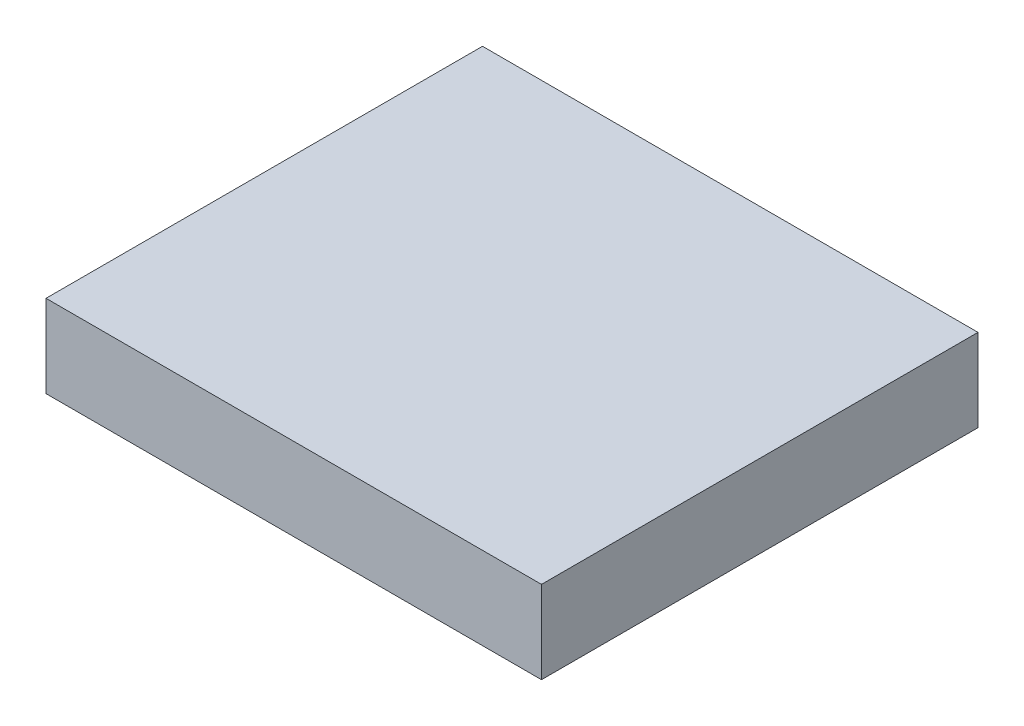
ISO-10303-21;
HEADER;
FILE_DESCRIPTION(('STEP AP214'),'2;1');
FILE_NAME('part.step','',(''),(''),'','','');
FILE_SCHEMA(('AUTOMOTIVE_DESIGN { 1 0 10303 214 1 1 1 1 }'));
ENDSEC;
DATA;
#1=APPLICATION_CONTEXT('core data for automotive mechanical design processes');
#2=APPLICATION_PROTOCOL_DEFINITION('international standard','automotive_design',2000,#1);
#3=PRODUCT_CONTEXT('',#1,'mechanical');
#4=PRODUCT('Part','Part','',(#3));
#5=PRODUCT_RELATED_PRODUCT_CATEGORY('part','',(#4));
#6=PRODUCT_DEFINITION_FORMATION('','',#4);
#7=PRODUCT_DEFINITION_CONTEXT('part definition',#1,'design');
#8=PRODUCT_DEFINITION('design','',#6,#7);
#9=PRODUCT_DEFINITION_SHAPE('','',#8);
#10=(LENGTH_UNIT() NAMED_UNIT(*) SI_UNIT(.MILLI.,.METRE.));
#11=(NAMED_UNIT(*) PLANE_ANGLE_UNIT() SI_UNIT($,.RADIAN.));
#12=(NAMED_UNIT(*) SI_UNIT($,.STERADIAN.) SOLID_ANGLE_UNIT());
#13=UNCERTAINTY_MEASURE_WITH_UNIT(LENGTH_MEASURE(1.E-05),#10,'distance_accuracy_value','');
#14=(GEOMETRIC_REPRESENTATION_CONTEXT(3) GLOBAL_UNCERTAINTY_ASSIGNED_CONTEXT((#13)) GLOBAL_UNIT_ASSIGNED_CONTEXT((#10,
#11,#12)) REPRESENTATION_CONTEXT('',''));
#15=CARTESIAN_POINT('',(0.,0.,0.));
#16=DIRECTION('',(0.,0.,1.));
#17=DIRECTION('',(1.,0.,0.));
#18=AXIS2_PLACEMENT_3D('',#15,#16,#17);
#19=CARTESIAN_POINT('',(902.93638391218,1060.,-175.));
#20=DIRECTION('',(0.,0.,-1.));
#21=DIRECTION('',(-1.,0.,0.));
#22=AXIS2_PLACEMENT_3D('',#19,#20,#21);
#23=PLANE('',#22);
#24=DIRECTION('',(0.,1.,0.));
#25=VECTOR('',#24,1.);
#26=CARTESIAN_POINT('',(702.93638391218,1060.,-175.));
#27=LINE('',#26,#25);
#28=CARTESIAN_POINT('',(702.93638391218,1000.,-175.));
#29=VERTEX_POINT('',#28);
#30=CARTESIAN_POINT('',(702.93638391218,1060.,-175.));
#31=VERTEX_POINT('',#30);
#32=EDGE_CURVE('E193',#29,#31,#27,.T.);
#33=ORIENTED_EDGE('',*,*,#32,.F.);
#34=DIRECTION('',(1.,0.,0.));
#35=VECTOR('',#34,1.);
#36=CARTESIAN_POINT('',(677.93638391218,1000.,-175.));
#37=LINE('',#36,#35);
#38=CARTESIAN_POINT('',(1102.93638391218,1000.,-175.));
#39=VERTEX_POINT('',#38);
#40=EDGE_CURVE('E180',#29,#39,#37,.T.);
#41=ORIENTED_EDGE('',*,*,#40,.T.);
#42=DIRECTION('',(0.,-1.,0.));
#43=VECTOR('',#42,1.);
#44=CARTESIAN_POINT('',(1102.93638391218,1060.,-175.));
#45=LINE('',#44,#43);
#46=CARTESIAN_POINT('',(1102.93638391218,1060.,-175.));
#47=VERTEX_POINT('',#46);
#48=EDGE_CURVE('E203',#47,#39,#45,.T.);
#49=ORIENTED_EDGE('',*,*,#48,.F.);
#50=DIRECTION('',(1.,0.,0.));
#51=VECTOR('',#50,1.);
#52=CARTESIAN_POINT('',(902.93638391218,1060.,-175.));
#53=LINE('',#52,#51);
#54=EDGE_CURVE('E188',#31,#47,#53,.T.);
#55=ORIENTED_EDGE('',*,*,#54,.F.);
#56=EDGE_LOOP('',(#33,#41,#49,#55));
#57=FACE_BOUND('',#56,.T.);
#58=ADVANCED_FACE('F33',(#57),#23,.F.);
#59=CARTESIAN_POINT('',(902.93638391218,1060.,175.));
#60=DIRECTION('',(0.,0.,1.));
#61=DIRECTION('',(1.,0.,0.));
#62=AXIS2_PLACEMENT_3D('',#59,#60,#61);
#63=PLANE('',#62);
#64=DIRECTION('',(0.,-1.,0.));
#65=VECTOR('',#64,1.);
#66=CARTESIAN_POINT('',(702.93638391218,1060.,175.));
#67=LINE('',#66,#65);
#68=CARTESIAN_POINT('',(702.93638391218,1060.,175.));
#69=VERTEX_POINT('',#68);
#70=CARTESIAN_POINT('',(702.93638391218,1000.,175.));
#71=VERTEX_POINT('',#70);
#72=EDGE_CURVE('E48',#69,#71,#67,.T.);
#73=ORIENTED_EDGE('',*,*,#72,.F.);
#74=DIRECTION('',(-1.,0.,0.));
#75=VECTOR('',#74,1.);
#76=CARTESIAN_POINT('',(902.93638391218,1060.,175.));
#77=LINE('',#76,#75);
#78=CARTESIAN_POINT('',(1102.93638391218,1060.,175.));
#79=VERTEX_POINT('',#78);
#80=EDGE_CURVE('E128',#79,#69,#77,.T.);
#81=ORIENTED_EDGE('',*,*,#80,.F.);
#82=DIRECTION('',(0.,1.,0.));
#83=VECTOR('',#82,1.);
#84=CARTESIAN_POINT('',(1102.93638391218,1060.,175.));
#85=LINE('',#84,#83);
#86=CARTESIAN_POINT('',(1102.93638391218,1000.,175.));
#87=VERTEX_POINT('',#86);
#88=EDGE_CURVE('E200',#87,#79,#85,.T.);
#89=ORIENTED_EDGE('',*,*,#88,.F.);
#90=DIRECTION('',(-1.,0.,0.));
#91=VECTOR('',#90,1.);
#92=CARTESIAN_POINT('',(677.93638391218,1000.,175.));
#93=LINE('',#92,#91);
#94=EDGE_CURVE('E189',#87,#71,#93,.T.);
#95=ORIENTED_EDGE('',*,*,#94,.T.);
#96=EDGE_LOOP('',(#73,#81,#89,#95));
#97=FACE_BOUND('',#96,.T.);
#98=ADVANCED_FACE('F158',(#97),#63,.F.);
#99=CARTESIAN_POINT('',(902.93638391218,1060.,0.));
#100=DIRECTION('',(0.,-1.,0.));
#101=DIRECTION('',(0.,0.,-1.));
#102=AXIS2_PLACEMENT_3D('',#99,#100,#101);
#103=PLANE('',#102);
#104=ORIENTED_EDGE('',*,*,#80,.T.);
#105=DIRECTION('',(0.,0.,-1.));
#106=VECTOR('',#105,1.);
#107=CARTESIAN_POINT('',(702.93638391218,1060.,0.));
#108=LINE('',#107,#106);
#109=EDGE_CURVE('E55',#69,#31,#108,.T.);
#110=ORIENTED_EDGE('',*,*,#109,.T.);
#111=ORIENTED_EDGE('',*,*,#54,.T.);
#112=DIRECTION('',(0.,0.,1.));
#113=VECTOR('',#112,1.);
#114=CARTESIAN_POINT('',(1102.93638391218,1060.,0.));
#115=LINE('',#114,#113);
#116=EDGE_CURVE('E11',#47,#79,#115,.T.);
#117=ORIENTED_EDGE('',*,*,#116,.T.);
#118=EDGE_LOOP('',(#104,#110,#111,#117));
#119=FACE_BOUND('',#118,.T.);
#120=ADVANCED_FACE('F155',(#119),#103,.T.);
#121=CARTESIAN_POINT('',(902.93638391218,1070.,-185.));
#122=DIRECTION('',(0.,0.,-1.));
#123=DIRECTION('',(-1.,0.,0.));
#124=AXIS2_PLACEMENT_3D('',#121,#122,#123);
#125=PLANE('',#124);
#126=DIRECTION('',(1.,0.,0.));
#127=VECTOR('',#126,1.);
#128=CARTESIAN_POINT('',(902.93638391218,1070.,-185.));
#129=LINE('',#128,#127);
#130=CARTESIAN_POINT('',(692.93638391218,1070.,-185.));
#131=VERTEX_POINT('',#130);
#132=CARTESIAN_POINT('',(1112.93638391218,1070.,-185.));
#133=VERTEX_POINT('',#132);
#134=EDGE_CURVE('E98',#131,#133,#129,.T.);
#135=ORIENTED_EDGE('',*,*,#134,.T.);
#136=DIRECTION('',(0.,-1.,0.));
#137=VECTOR('',#136,1.);
#138=CARTESIAN_POINT('',(1112.93638391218,1070.,-185.));
#139=LINE('',#138,#137);
#140=CARTESIAN_POINT('',(1112.93638391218,1000.,-185.));
#141=VERTEX_POINT('',#140);
#142=EDGE_CURVE('E101',#133,#141,#139,.T.);
#143=ORIENTED_EDGE('',*,*,#142,.T.);
#144=DIRECTION('',(1.,0.,0.));
#145=VECTOR('',#144,1.);
#146=CARTESIAN_POINT('',(902.93638391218,1000.,-185.));
#147=LINE('',#146,#145);
#148=CARTESIAN_POINT('',(692.93638391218,1000.,-185.));
#149=VERTEX_POINT('',#148);
#150=EDGE_CURVE('E126',#149,#141,#147,.T.);
#151=ORIENTED_EDGE('',*,*,#150,.F.);
#152=DIRECTION('',(0.,-1.,0.));
#153=VECTOR('',#152,1.);
#154=CARTESIAN_POINT('',(692.93638391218,1070.,-185.));
#155=LINE('',#154,#153);
#156=EDGE_CURVE('E41',#131,#149,#155,.T.);
#157=ORIENTED_EDGE('',*,*,#156,.F.);
#158=EDGE_LOOP('',(#135,#143,#151,#157));
#159=FACE_BOUND('',#158,.T.);
#160=ADVANCED_FACE('F35',(#159),#125,.T.);
#161=CARTESIAN_POINT('',(692.93638391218,1070.,0.));
#162=DIRECTION('',(-1.,0.,0.));
#163=DIRECTION('',(0.,0.,1.));
#164=AXIS2_PLACEMENT_3D('',#161,#162,#163);
#165=PLANE('',#164);
#166=ORIENTED_EDGE('',*,*,#156,.T.);
#167=DIRECTION('',(0.,0.,-1.));
#168=VECTOR('',#167,1.);
#169=CARTESIAN_POINT('',(692.93638391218,1000.,0.));
#170=LINE('',#169,#168);
#171=CARTESIAN_POINT('',(692.93638391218,1000.,185.));
#172=VERTEX_POINT('',#171);
#173=EDGE_CURVE('E109',#172,#149,#170,.T.);
#174=ORIENTED_EDGE('',*,*,#173,.F.);
#175=DIRECTION('',(0.,-1.,0.));
#176=VECTOR('',#175,1.);
#177=CARTESIAN_POINT('',(692.93638391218,1070.,185.));
#178=LINE('',#177,#176);
#179=CARTESIAN_POINT('',(692.93638391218,1070.,185.));
#180=VERTEX_POINT('',#179);
#181=EDGE_CURVE('E134',#180,#172,#178,.T.);
#182=ORIENTED_EDGE('',*,*,#181,.F.);
#183=DIRECTION('',(0.,0.,-1.));
#184=VECTOR('',#183,1.);
#185=CARTESIAN_POINT('',(692.93638391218,1070.,0.));
#186=LINE('',#185,#184);
#187=EDGE_CURVE('E117',#180,#131,#186,.T.);
#188=ORIENTED_EDGE('',*,*,#187,.T.);
#189=EDGE_LOOP('',(#166,#174,#182,#188));
#190=FACE_BOUND('',#189,.T.);
#191=ADVANCED_FACE('F145',(#190),#165,.T.);
#192=CARTESIAN_POINT('',(902.93638391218,1070.,185.));
#193=DIRECTION('',(0.,0.,1.));
#194=DIRECTION('',(1.,0.,0.));
#195=AXIS2_PLACEMENT_3D('',#192,#193,#194);
#196=PLANE('',#195);
#197=ORIENTED_EDGE('',*,*,#181,.T.);
#198=DIRECTION('',(-1.,0.,0.));
#199=VECTOR('',#198,1.);
#200=CARTESIAN_POINT('',(902.93638391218,1000.,185.));
#201=LINE('',#200,#199);
#202=CARTESIAN_POINT('',(1112.93638391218,1000.,185.));
#203=VERTEX_POINT('',#202);
#204=EDGE_CURVE('E130',#203,#172,#201,.T.);
#205=ORIENTED_EDGE('',*,*,#204,.F.);
#206=DIRECTION('',(0.,-1.,0.));
#207=VECTOR('',#206,1.);
#208=CARTESIAN_POINT('',(1112.93638391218,1070.,185.));
#209=LINE('',#208,#207);
#210=CARTESIAN_POINT('',(1112.93638391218,1070.,185.));
#211=VERTEX_POINT('',#210);
#212=EDGE_CURVE('E116',#211,#203,#209,.T.);
#213=ORIENTED_EDGE('',*,*,#212,.F.);
#214=DIRECTION('',(-1.,0.,0.));
#215=VECTOR('',#214,1.);
#216=CARTESIAN_POINT('',(902.93638391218,1070.,185.));
#217=LINE('',#216,#215);
#218=EDGE_CURVE('E120',#211,#180,#217,.T.);
#219=ORIENTED_EDGE('',*,*,#218,.T.);
#220=EDGE_LOOP('',(#197,#205,#213,#219));
#221=FACE_BOUND('',#220,.T.);
#222=ADVANCED_FACE('F139',(#221),#196,.T.);
#223=CARTESIAN_POINT('',(1112.93638391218,1070.,0.));
#224=DIRECTION('',(1.,0.,0.));
#225=DIRECTION('',(0.,0.,-1.));
#226=AXIS2_PLACEMENT_3D('',#223,#224,#225);
#227=PLANE('',#226);
#228=ORIENTED_EDGE('',*,*,#212,.T.);
#229=DIRECTION('',(0.,0.,1.));
#230=VECTOR('',#229,1.);
#231=CARTESIAN_POINT('',(1112.93638391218,1000.,0.));
#232=LINE('',#231,#230);
#233=EDGE_CURVE('E115',#141,#203,#232,.T.);
#234=ORIENTED_EDGE('',*,*,#233,.F.);
#235=ORIENTED_EDGE('',*,*,#142,.F.);
#236=DIRECTION('',(0.,0.,1.));
#237=VECTOR('',#236,1.);
#238=CARTESIAN_POINT('',(1112.93638391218,1070.,0.));
#239=LINE('',#238,#237);
#240=EDGE_CURVE('E108',#133,#211,#239,.T.);
#241=ORIENTED_EDGE('',*,*,#240,.T.);
#242=EDGE_LOOP('',(#228,#234,#235,#241));
#243=FACE_BOUND('',#242,.T.);
#244=ADVANCED_FACE('F114',(#243),#227,.T.);
#245=CARTESIAN_POINT('',(902.93638391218,1070.,0.));
#246=DIRECTION('',(0.,-1.,0.));
#247=DIRECTION('',(0.,0.,-1.));
#248=AXIS2_PLACEMENT_3D('',#245,#246,#247);
#249=PLANE('',#248);
#250=ORIENTED_EDGE('',*,*,#187,.F.);
#251=ORIENTED_EDGE('',*,*,#218,.F.);
#252=ORIENTED_EDGE('',*,*,#240,.F.);
#253=ORIENTED_EDGE('',*,*,#134,.F.);
#254=EDGE_LOOP('',(#250,#251,#252,#253));
#255=FACE_BOUND('',#254,.T.);
#256=ADVANCED_FACE('F119',(#255),#249,.F.);
#257=CARTESIAN_POINT('',(902.93638391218,1000.,0.));
#258=DIRECTION('',(0.,-1.,0.));
#259=DIRECTION('',(0.,0.,-1.));
#260=AXIS2_PLACEMENT_3D('',#257,#258,#259);
#261=PLANE('',#260);
#262=ORIENTED_EDGE('',*,*,#40,.F.);
#263=DIRECTION('',(0.,0.,1.));
#264=VECTOR('',#263,1.);
#265=CARTESIAN_POINT('',(702.93638391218,1000.,185.));
#266=LINE('',#265,#264);
#267=EDGE_CURVE('E183',#29,#71,#266,.T.);
#268=ORIENTED_EDGE('',*,*,#267,.T.);
#269=ORIENTED_EDGE('',*,*,#94,.F.);
#270=DIRECTION('',(0.,0.,-1.));
#271=VECTOR('',#270,1.);
#272=CARTESIAN_POINT('',(1102.93638391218,1000.,185.));
#273=LINE('',#272,#271);
#274=EDGE_CURVE('E185',#87,#39,#273,.T.);
#275=ORIENTED_EDGE('',*,*,#274,.T.);
#276=EDGE_LOOP('',(#262,#268,#269,#275));
#277=FACE_BOUND('',#276,.T.);
#278=ORIENTED_EDGE('',*,*,#150,.T.);
#279=ORIENTED_EDGE('',*,*,#233,.T.);
#280=ORIENTED_EDGE('',*,*,#204,.T.);
#281=ORIENTED_EDGE('',*,*,#173,.T.);
#282=EDGE_LOOP('',(#278,#279,#280,#281));
#283=FACE_BOUND('',#282,.T.);
#284=ADVANCED_FACE('F143',(#277,#283),#261,.T.);
#285=CARTESIAN_POINT('',(1102.93638391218,0.,0.));
#286=DIRECTION('',(1.,0.,0.));
#287=DIRECTION('',(0.,0.,-1.));
#288=AXIS2_PLACEMENT_3D('',#285,#286,#287);
#289=PLANE('',#288);
#290=ORIENTED_EDGE('',*,*,#116,.F.);
#291=ORIENTED_EDGE('',*,*,#48,.T.);
#292=ORIENTED_EDGE('',*,*,#274,.F.);
#293=ORIENTED_EDGE('',*,*,#88,.T.);
#294=EDGE_LOOP('',(#290,#291,#292,#293));
#295=FACE_BOUND('',#294,.T.);
#296=ADVANCED_FACE('F169',(#295),#289,.F.);
#297=CARTESIAN_POINT('',(702.93638391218,0.,0.));
#298=DIRECTION('',(-1.,0.,0.));
#299=DIRECTION('',(0.,0.,1.));
#300=AXIS2_PLACEMENT_3D('',#297,#298,#299);
#301=PLANE('',#300);
#302=ORIENTED_EDGE('',*,*,#267,.F.);
#303=ORIENTED_EDGE('',*,*,#32,.T.);
#304=ORIENTED_EDGE('',*,*,#109,.F.);
#305=ORIENTED_EDGE('',*,*,#72,.T.);
#306=EDGE_LOOP('',(#302,#303,#304,#305));
#307=FACE_BOUND('',#306,.T.);
#308=ADVANCED_FACE('F174',(#307),#301,.F.);
#309=CLOSED_SHELL('',(#58,#98,#120,#160,#191,#222,#244,#256,#284,#296,#308));
#310=MANIFOLD_SOLID_BREP('B2',#309);
#311=ADVANCED_BREP_SHAPE_REPRESENTATION('',(#18,#310),#14);
#312=SHAPE_DEFINITION_REPRESENTATION(#9,#311);
ENDSEC;
END-ISO-10303-21;
